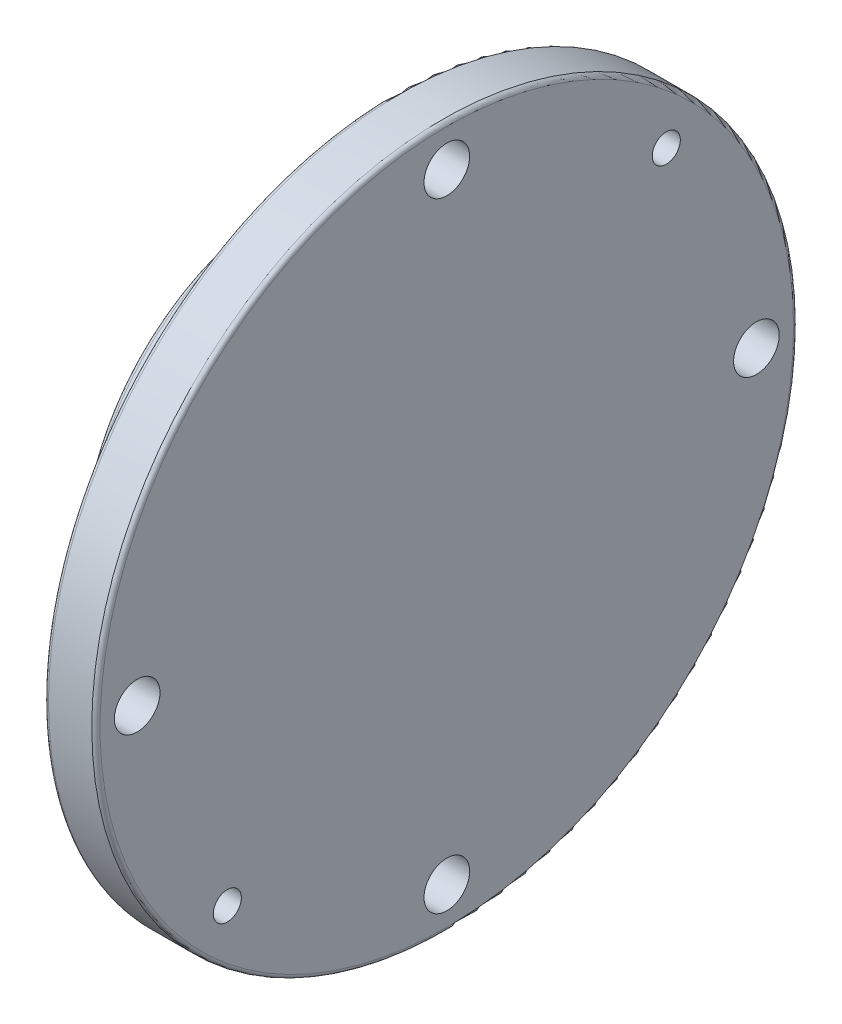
ISO-10303-21;
HEADER;
FILE_DESCRIPTION(('STEP AP214'),'2;1');
FILE_NAME('part.step','',(''),(''),'','','');
FILE_SCHEMA(('AUTOMOTIVE_DESIGN { 1 0 10303 214 1 1 1 1 }'));
ENDSEC;
DATA;
#1=APPLICATION_CONTEXT('core data for automotive mechanical design processes');
#2=APPLICATION_PROTOCOL_DEFINITION('international standard','automotive_design',2000,#1);
#3=PRODUCT_CONTEXT('',#1,'mechanical');
#4=PRODUCT('Part','Part','',(#3));
#5=PRODUCT_RELATED_PRODUCT_CATEGORY('part','',(#4));
#6=PRODUCT_DEFINITION_FORMATION('','',#4);
#7=PRODUCT_DEFINITION_CONTEXT('part definition',#1,'design');
#8=PRODUCT_DEFINITION('design','',#6,#7);
#9=PRODUCT_DEFINITION_SHAPE('','',#8);
#10=(LENGTH_UNIT() NAMED_UNIT(*) SI_UNIT(.MILLI.,.METRE.));
#11=(NAMED_UNIT(*) PLANE_ANGLE_UNIT() SI_UNIT($,.RADIAN.));
#12=(NAMED_UNIT(*) SI_UNIT($,.STERADIAN.) SOLID_ANGLE_UNIT());
#13=UNCERTAINTY_MEASURE_WITH_UNIT(LENGTH_MEASURE(1.E-05),#10,'distance_accuracy_value','');
#14=(GEOMETRIC_REPRESENTATION_CONTEXT(3) GLOBAL_UNCERTAINTY_ASSIGNED_CONTEXT((#13)) GLOBAL_UNIT_ASSIGNED_CONTEXT((#10,
#11,#12)) REPRESENTATION_CONTEXT('',''));
#15=CARTESIAN_POINT('',(0.,0.,0.));
#16=DIRECTION('',(0.,0.,1.));
#17=DIRECTION('',(1.,0.,0.));
#18=AXIS2_PLACEMENT_3D('',#15,#16,#17);
#19=CARTESIAN_POINT('',(0.,0.,0.));
#20=DIRECTION('',(1.,0.,0.));
#21=DIRECTION('',(0.,0.,-1.));
#22=AXIS2_PLACEMENT_3D('',#19,#20,#21);
#23=PLANE('',#22);
#24=CARTESIAN_POINT('',(0.,-26.8726771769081,27.0086878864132));
#25=DIRECTION('',(1.,0.,0.));
#26=DIRECTION('',(0.,0.,-1.));
#27=AXIS2_PLACEMENT_3D('',#24,#25,#26);
#28=CIRCLE('',#27,1.72719999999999);
#29=CARTESIAN_POINT('',(0.,-26.8726771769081,25.2814878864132));
#30=VERTEX_POINT('',#29);
#31=EDGE_CURVE('E422',#30,#30,#28,.T.);
#32=ORIENTED_EDGE('',*,*,#31,.F.);
#33=EDGE_LOOP('',(#32));
#34=FACE_BOUND('',#33,.T.);
#35=CARTESIAN_POINT('',(0.,26.8726771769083,-27.008687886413));
#36=DIRECTION('',(1.,0.,0.));
#37=DIRECTION('',(0.,0.,-1.));
#38=AXIS2_PLACEMENT_3D('',#35,#36,#37);
#39=CIRCLE('',#38,1.72719999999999);
#40=CARTESIAN_POINT('',(0.,26.8726771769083,-28.735887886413));
#41=VERTEX_POINT('',#40);
#42=EDGE_CURVE('E412',#41,#41,#39,.T.);
#43=ORIENTED_EDGE('',*,*,#42,.F.);
#44=EDGE_LOOP('',(#43));
#45=FACE_BOUND('',#44,.T.);
#46=CARTESIAN_POINT('',(0.,0.,38.1));
#47=DIRECTION('',(1.,0.,0.));
#48=DIRECTION('',(0.,0.,-1.));
#49=AXIS2_PLACEMENT_3D('',#46,#47,#48);
#50=CIRCLE('',#49,2.8067);
#51=CARTESIAN_POINT('',(0.,0.,35.2933));
#52=VERTEX_POINT('',#51);
#53=EDGE_CURVE('E409',#52,#52,#50,.T.);
#54=ORIENTED_EDGE('',*,*,#53,.F.);
#55=EDGE_LOOP('',(#54));
#56=FACE_BOUND('',#55,.T.);
#57=CARTESIAN_POINT('',(0.,-38.1,0.));
#58=DIRECTION('',(1.,0.,0.));
#59=DIRECTION('',(0.,0.,-1.));
#60=AXIS2_PLACEMENT_3D('',#57,#58,#59);
#61=CIRCLE('',#60,2.80670000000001);
#62=CARTESIAN_POINT('',(0.,-38.1,-2.80670000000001));
#63=VERTEX_POINT('',#62);
#64=EDGE_CURVE('E406',#63,#63,#61,.T.);
#65=ORIENTED_EDGE('',*,*,#64,.F.);
#66=EDGE_LOOP('',(#65));
#67=FACE_BOUND('',#66,.T.);
#68=CARTESIAN_POINT('',(0.,0.,-38.1));
#69=DIRECTION('',(1.,0.,0.));
#70=DIRECTION('',(0.,0.,-1.));
#71=AXIS2_PLACEMENT_3D('',#68,#69,#70);
#72=CIRCLE('',#71,2.8067);
#73=CARTESIAN_POINT('',(0.,0.,-40.9067));
#74=VERTEX_POINT('',#73);
#75=EDGE_CURVE('E402',#74,#74,#72,.T.);
#76=ORIENTED_EDGE('',*,*,#75,.F.);
#77=EDGE_LOOP('',(#76));
#78=FACE_BOUND('',#77,.T.);
#79=CARTESIAN_POINT('',(0.,38.1,0.));
#80=DIRECTION('',(1.,0.,0.));
#81=DIRECTION('',(0.,0.,-1.));
#82=AXIS2_PLACEMENT_3D('',#79,#80,#81);
#83=CIRCLE('',#82,2.8067);
#84=CARTESIAN_POINT('',(0.,38.1,-2.8067));
#85=VERTEX_POINT('',#84);
#86=EDGE_CURVE('E398',#85,#85,#83,.T.);
#87=ORIENTED_EDGE('',*,*,#86,.F.);
#88=EDGE_LOOP('',(#87));
#89=FACE_BOUND('',#88,.T.);
#90=CARTESIAN_POINT('',(0.,0.,0.));
#91=DIRECTION('',(1.,0.,0.));
#92=DIRECTION('',(0.,0.,-1.));
#93=AXIS2_PLACEMENT_3D('',#90,#91,#92);
#94=CIRCLE('',#93,42.672);
#95=CARTESIAN_POINT('',(0.,0.,-42.672));
#96=VERTEX_POINT('',#95);
#97=EDGE_CURVE('E10',#96,#96,#94,.T.);
#98=ORIENTED_EDGE('',*,*,#97,.T.);
#99=EDGE_LOOP('',(#98));
#100=FACE_BOUND('',#99,.T.);
#101=ADVANCED_FACE('F378',(#34,#45,#56,#67,#78,#89,#100),#23,.T.);
#102=CARTESIAN_POINT('',(-0.508000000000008,0.,0.));
#103=DIRECTION('',(1.,0.,0.));
#104=DIRECTION('',(0.,0.,-1.));
#105=AXIS2_PLACEMENT_3D('',#102,#103,#104);
#106=TOROIDAL_SURFACE('',#105,42.672,0.508000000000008);
#107=CARTESIAN_POINT('',(-0.508000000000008,0.,0.));
#108=DIRECTION('',(1.,0.,0.));
#109=DIRECTION('',(0.,0.,-1.));
#110=AXIS2_PLACEMENT_3D('',#107,#108,#109);
#111=CIRCLE('',#110,43.18);
#112=CARTESIAN_POINT('',(-0.508000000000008,0.,-43.18));
#113=VERTEX_POINT('',#112);
#114=EDGE_CURVE('E385',#113,#113,#111,.T.);
#115=ORIENTED_EDGE('',*,*,#114,.T.);
#116=EDGE_LOOP('',(#115));
#117=FACE_BOUND('',#116,.T.);
#118=ORIENTED_EDGE('',*,*,#97,.F.);
#119=EDGE_LOOP('',(#118));
#120=FACE_BOUND('',#119,.T.);
#121=ADVANCED_FACE('F511',(#117,#120),#106,.T.);
#122=CARTESIAN_POINT('',(0.,0.,0.));
#123=DIRECTION('',(1.,0.,0.));
#124=DIRECTION('',(0.,0.,-1.));
#125=AXIS2_PLACEMENT_3D('',#122,#123,#124);
#126=CYLINDRICAL_SURFACE('',#125,43.18);
#127=CARTESIAN_POINT('',(-5.84199999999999,0.,0.));
#128=DIRECTION('',(1.,0.,0.));
#129=DIRECTION('',(0.,0.,-1.));
#130=AXIS2_PLACEMENT_3D('',#127,#128,#129);
#131=CIRCLE('',#130,43.18);
#132=CARTESIAN_POINT('',(-5.84199999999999,0.,-43.18));
#133=VERTEX_POINT('',#132);
#134=EDGE_CURVE('E390',#133,#133,#131,.T.);
#135=ORIENTED_EDGE('',*,*,#134,.T.);
#136=EDGE_LOOP('',(#135));
#137=FACE_BOUND('',#136,.T.);
#138=ORIENTED_EDGE('',*,*,#114,.F.);
#139=EDGE_LOOP('',(#138));
#140=FACE_BOUND('',#139,.T.);
#141=ADVANCED_FACE('F495',(#137,#140),#126,.T.);
#142=CARTESIAN_POINT('',(-5.84199999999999,0.,0.));
#143=DIRECTION('',(1.,0.,0.));
#144=DIRECTION('',(0.,0.,-1.));
#145=AXIS2_PLACEMENT_3D('',#142,#143,#144);
#146=TOROIDAL_SURFACE('',#145,42.672,0.507999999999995);
#147=CARTESIAN_POINT('',(-6.34999999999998,0.,0.));
#148=DIRECTION('',(1.,0.,0.));
#149=DIRECTION('',(0.,0.,-1.));
#150=AXIS2_PLACEMENT_3D('',#147,#148,#149);
#151=CIRCLE('',#150,42.672);
#152=CARTESIAN_POINT('',(-6.34999999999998,0.,-42.672));
#153=VERTEX_POINT('',#152);
#154=EDGE_CURVE('E490',#153,#153,#151,.T.);
#155=ORIENTED_EDGE('',*,*,#154,.T.);
#156=EDGE_LOOP('',(#155));
#157=FACE_BOUND('',#156,.T.);
#158=ORIENTED_EDGE('',*,*,#134,.F.);
#159=EDGE_LOOP('',(#158));
#160=FACE_BOUND('',#159,.T.);
#161=ADVANCED_FACE('F498',(#157,#160),#146,.T.);
#162=CARTESIAN_POINT('',(-6.35,33.2486,0.));
#163=DIRECTION('',(-1.,0.,0.));
#164=DIRECTION('',(0.,0.,1.));
#165=AXIS2_PLACEMENT_3D('',#162,#163,#164);
#166=PLANE('',#165);
#167=CARTESIAN_POINT('',(-6.35,-26.8726771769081,27.0086878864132));
#168=DIRECTION('',(-1.,0.,0.));
#169=DIRECTION('',(0.,0.,1.));
#170=AXIS2_PLACEMENT_3D('',#167,#168,#169);
#171=CIRCLE('',#170,1.72719999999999);
#172=CARTESIAN_POINT('',(-6.35,-26.8726771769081,28.7358878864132));
#173=VERTEX_POINT('',#172);
#174=EDGE_CURVE('E381',#173,#173,#171,.T.);
#175=ORIENTED_EDGE('',*,*,#174,.F.);
#176=EDGE_LOOP('',(#175));
#177=FACE_BOUND('',#176,.T.);
#178=CARTESIAN_POINT('',(-6.35,26.8726771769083,-27.008687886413));
#179=DIRECTION('',(-1.,0.,0.));
#180=DIRECTION('',(0.,0.,1.));
#181=AXIS2_PLACEMENT_3D('',#178,#179,#180);
#182=CIRCLE('',#181,1.72719999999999);
#183=CARTESIAN_POINT('',(-6.35,26.8726771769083,-25.281487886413));
#184=VERTEX_POINT('',#183);
#185=EDGE_CURVE('E410',#184,#184,#182,.T.);
#186=ORIENTED_EDGE('',*,*,#185,.F.);
#187=EDGE_LOOP('',(#186));
#188=FACE_BOUND('',#187,.T.);
#189=CARTESIAN_POINT('',(-6.35,0.,38.1));
#190=DIRECTION('',(-1.,0.,0.));
#191=DIRECTION('',(0.,0.,1.));
#192=AXIS2_PLACEMENT_3D('',#189,#190,#191);
#193=CIRCLE('',#192,2.8067);
#194=CARTESIAN_POINT('',(-6.35,0.,40.9067));
#195=VERTEX_POINT('',#194);
#196=EDGE_CURVE('E407',#195,#195,#193,.T.);
#197=ORIENTED_EDGE('',*,*,#196,.F.);
#198=EDGE_LOOP('',(#197));
#199=FACE_BOUND('',#198,.T.);
#200=CARTESIAN_POINT('',(-6.35,-38.1,0.));
#201=DIRECTION('',(-1.,0.,0.));
#202=DIRECTION('',(0.,0.,1.));
#203=AXIS2_PLACEMENT_3D('',#200,#201,#202);
#204=CIRCLE('',#203,2.80670000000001);
#205=CARTESIAN_POINT('',(-6.35,-38.1,2.80670000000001));
#206=VERTEX_POINT('',#205);
#207=EDGE_CURVE('E403',#206,#206,#204,.T.);
#208=ORIENTED_EDGE('',*,*,#207,.F.);
#209=EDGE_LOOP('',(#208));
#210=FACE_BOUND('',#209,.T.);
#211=CARTESIAN_POINT('',(-6.35,0.,-38.1));
#212=DIRECTION('',(-1.,0.,0.));
#213=DIRECTION('',(0.,0.,1.));
#214=AXIS2_PLACEMENT_3D('',#211,#212,#213);
#215=CIRCLE('',#214,2.8067);
#216=CARTESIAN_POINT('',(-6.35,0.,-35.2933));
#217=VERTEX_POINT('',#216);
#218=EDGE_CURVE('E399',#217,#217,#215,.T.);
#219=ORIENTED_EDGE('',*,*,#218,.F.);
#220=EDGE_LOOP('',(#219));
#221=FACE_BOUND('',#220,.T.);
#222=CARTESIAN_POINT('',(-6.35,38.1,0.));
#223=DIRECTION('',(-1.,0.,0.));
#224=DIRECTION('',(0.,0.,1.));
#225=AXIS2_PLACEMENT_3D('',#222,#223,#224);
#226=CIRCLE('',#225,2.8067);
#227=CARTESIAN_POINT('',(-6.35,38.1,2.8067));
#228=VERTEX_POINT('',#227);
#229=EDGE_CURVE('E394',#228,#228,#226,.T.);
#230=ORIENTED_EDGE('',*,*,#229,.F.);
#231=EDGE_LOOP('',(#230));
#232=FACE_BOUND('',#231,.T.);
#233=CARTESIAN_POINT('',(-6.35000000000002,0.,0.));
#234=DIRECTION('',(1.,0.,0.));
#235=DIRECTION('',(0.,0.,-1.));
#236=AXIS2_PLACEMENT_3D('',#233,#234,#235);
#237=CIRCLE('',#236,33.2486);
#238=CARTESIAN_POINT('',(-6.35000000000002,0.,-33.2486));
#239=VERTEX_POINT('',#238);
#240=EDGE_CURVE('E487',#239,#239,#237,.T.);
#241=ORIENTED_EDGE('',*,*,#240,.T.);
#242=EDGE_LOOP('',(#241));
#243=FACE_BOUND('',#242,.T.);
#244=ORIENTED_EDGE('',*,*,#154,.F.);
#245=EDGE_LOOP('',(#244));
#246=FACE_BOUND('',#245,.T.);
#247=ADVANCED_FACE('F500',(#177,#188,#199,#210,#221,#232,#243,#246),#166,.T.);
#248=CARTESIAN_POINT('',(-6.22300000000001,0.,0.));
#249=DIRECTION('',(1.,0.,0.));
#250=DIRECTION('',(0.,0.,-1.));
#251=AXIS2_PLACEMENT_3D('',#248,#249,#250);
#252=TOROIDAL_SURFACE('',#251,33.2486,0.127000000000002);
#253=CARTESIAN_POINT('',(-6.22300000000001,0.,0.));
#254=DIRECTION('',(1.,0.,0.));
#255=DIRECTION('',(0.,0.,-1.));
#256=AXIS2_PLACEMENT_3D('',#253,#254,#255);
#257=CIRCLE('',#256,33.1216);
#258=CARTESIAN_POINT('',(-6.22300000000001,0.,-33.1216));
#259=VERTEX_POINT('',#258);
#260=EDGE_CURVE('E484',#259,#259,#257,.T.);
#261=ORIENTED_EDGE('',*,*,#260,.T.);
#262=EDGE_LOOP('',(#261));
#263=FACE_BOUND('',#262,.T.);
#264=ORIENTED_EDGE('',*,*,#240,.F.);
#265=EDGE_LOOP('',(#264));
#266=FACE_BOUND('',#265,.T.);
#267=ADVANCED_FACE('F508',(#263,#266),#252,.T.);
#268=CARTESIAN_POINT('',(0.,0.,0.));
#269=DIRECTION('',(1.,0.,0.));
#270=DIRECTION('',(0.,0.,-1.));
#271=AXIS2_PLACEMENT_3D('',#268,#269,#270);
#272=CYLINDRICAL_SURFACE('',#271,33.1216);
#273=CARTESIAN_POINT('',(-4.14019999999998,0.,0.));
#274=DIRECTION('',(1.,0.,0.));
#275=DIRECTION('',(0.,0.,-1.));
#276=AXIS2_PLACEMENT_3D('',#273,#274,#275);
#277=CIRCLE('',#276,33.1216);
#278=CARTESIAN_POINT('',(-4.14019999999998,0.,-33.1216));
#279=VERTEX_POINT('',#278);
#280=EDGE_CURVE('E481',#279,#279,#277,.T.);
#281=ORIENTED_EDGE('',*,*,#280,.T.);
#282=EDGE_LOOP('',(#281));
#283=FACE_BOUND('',#282,.T.);
#284=ORIENTED_EDGE('',*,*,#260,.F.);
#285=EDGE_LOOP('',(#284));
#286=FACE_BOUND('',#285,.T.);
#287=ADVANCED_FACE('F616',(#283,#286),#272,.F.);
#288=CARTESIAN_POINT('',(-4.14019999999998,0.,0.));
#289=DIRECTION('',(1.,0.,0.));
#290=DIRECTION('',(0.,0.,-1.));
#291=AXIS2_PLACEMENT_3D('',#288,#289,#290);
#292=TOROIDAL_SURFACE('',#291,32.6136,0.508000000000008);
#293=CARTESIAN_POINT('',(-3.63219999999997,0.,0.));
#294=DIRECTION('',(1.,0.,0.));
#295=DIRECTION('',(0.,0.,-1.));
#296=AXIS2_PLACEMENT_3D('',#293,#294,#295);
#297=CIRCLE('',#296,32.6136);
#298=CARTESIAN_POINT('',(-3.63219999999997,0.,-32.6136));
#299=VERTEX_POINT('',#298);
#300=EDGE_CURVE('E478',#299,#299,#297,.T.);
#301=ORIENTED_EDGE('',*,*,#300,.T.);
#302=EDGE_LOOP('',(#301));
#303=FACE_BOUND('',#302,.T.);
#304=ORIENTED_EDGE('',*,*,#280,.F.);
#305=EDGE_LOOP('',(#304));
#306=FACE_BOUND('',#305,.T.);
#307=ADVANCED_FACE('F612',(#303,#306),#292,.F.);
#308=CARTESIAN_POINT('',(-3.63219999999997,28.8798,0.));
#309=DIRECTION('',(-1.,0.,0.));
#310=DIRECTION('',(0.,0.,1.));
#311=AXIS2_PLACEMENT_3D('',#308,#309,#310);
#312=PLANE('',#311);
#313=CARTESIAN_POINT('',(-3.63219999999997,0.,0.));
#314=DIRECTION('',(1.,0.,0.));
#315=DIRECTION('',(0.,0.,-1.));
#316=AXIS2_PLACEMENT_3D('',#313,#314,#315);
#317=CIRCLE('',#316,28.8798);
#318=CARTESIAN_POINT('',(-3.63219999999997,0.,-28.8798));
#319=VERTEX_POINT('',#318);
#320=EDGE_CURVE('E475',#319,#319,#317,.T.);
#321=ORIENTED_EDGE('',*,*,#320,.T.);
#322=EDGE_LOOP('',(#321));
#323=FACE_BOUND('',#322,.T.);
#324=ORIENTED_EDGE('',*,*,#300,.F.);
#325=EDGE_LOOP('',(#324));
#326=FACE_BOUND('',#325,.T.);
#327=ADVANCED_FACE('F608',(#323,#326),#312,.T.);
#328=CARTESIAN_POINT('',(-4.14019999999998,0.,0.));
#329=DIRECTION('',(1.,0.,0.));
#330=DIRECTION('',(0.,0.,-1.));
#331=AXIS2_PLACEMENT_3D('',#328,#329,#330);
#332=TOROIDAL_SURFACE('',#331,28.8798,0.508000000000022);
#333=CARTESIAN_POINT('',(-4.14019999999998,0.,0.));
#334=DIRECTION('',(1.,0.,0.));
#335=DIRECTION('',(0.,0.,-1.));
#336=AXIS2_PLACEMENT_3D('',#333,#334,#335);
#337=CIRCLE('',#336,28.3718);
#338=CARTESIAN_POINT('',(-4.14019999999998,0.,-28.3718));
#339=VERTEX_POINT('',#338);
#340=EDGE_CURVE('E472',#339,#339,#337,.T.);
#341=ORIENTED_EDGE('',*,*,#340,.T.);
#342=EDGE_LOOP('',(#341));
#343=FACE_BOUND('',#342,.T.);
#344=ORIENTED_EDGE('',*,*,#320,.F.);
#345=EDGE_LOOP('',(#344));
#346=FACE_BOUND('',#345,.T.);
#347=ADVANCED_FACE('F604',(#343,#346),#332,.F.);
#348=CARTESIAN_POINT('',(0.,0.,0.));
#349=DIRECTION('',(1.,0.,0.));
#350=DIRECTION('',(0.,0.,-1.));
#351=AXIS2_PLACEMENT_3D('',#348,#349,#350);
#352=CYLINDRICAL_SURFACE('',#351,28.3718);
#353=CARTESIAN_POINT('',(-6.22300000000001,0.,0.));
#354=DIRECTION('',(1.,0.,0.));
#355=DIRECTION('',(0.,0.,-1.));
#356=AXIS2_PLACEMENT_3D('',#353,#354,#355);
#357=CIRCLE('',#356,28.3718);
#358=CARTESIAN_POINT('',(-6.22300000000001,0.,-28.3718));
#359=VERTEX_POINT('',#358);
#360=EDGE_CURVE('E469',#359,#359,#357,.T.);
#361=ORIENTED_EDGE('',*,*,#360,.T.);
#362=EDGE_LOOP('',(#361));
#363=FACE_BOUND('',#362,.T.);
#364=ORIENTED_EDGE('',*,*,#340,.F.);
#365=EDGE_LOOP('',(#364));
#366=FACE_BOUND('',#365,.T.);
#367=ADVANCED_FACE('F600',(#363,#366),#352,.T.);
#368=CARTESIAN_POINT('',(-6.22300000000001,0.,0.));
#369=DIRECTION('',(1.,0.,0.));
#370=DIRECTION('',(0.,0.,-1.));
#371=AXIS2_PLACEMENT_3D('',#368,#369,#370);
#372=TOROIDAL_SURFACE('',#371,28.2448,0.12699999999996);
#373=CARTESIAN_POINT('',(-6.34999999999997,0.,0.));
#374=DIRECTION('',(1.,0.,0.));
#375=DIRECTION('',(0.,0.,-1.));
#376=AXIS2_PLACEMENT_3D('',#373,#374,#375);
#377=CIRCLE('',#376,28.2448);
#378=CARTESIAN_POINT('',(-6.34999999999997,0.,-28.2448));
#379=VERTEX_POINT('',#378);
#380=EDGE_CURVE('E466',#379,#379,#377,.T.);
#381=ORIENTED_EDGE('',*,*,#380,.T.);
#382=EDGE_LOOP('',(#381));
#383=FACE_BOUND('',#382,.T.);
#384=ORIENTED_EDGE('',*,*,#360,.F.);
#385=EDGE_LOOP('',(#384));
#386=FACE_BOUND('',#385,.T.);
#387=ADVANCED_FACE('F596',(#383,#386),#372,.T.);
#388=CARTESIAN_POINT('',(-6.34999999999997,26.1239,0.));
#389=DIRECTION('',(-1.,0.,0.));
#390=DIRECTION('',(0.,0.,1.));
#391=AXIS2_PLACEMENT_3D('',#388,#389,#390);
#392=PLANE('',#391);
#393=CARTESIAN_POINT('',(-6.34999999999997,0.,0.));
#394=DIRECTION('',(1.,0.,0.));
#395=DIRECTION('',(0.,0.,-1.));
#396=AXIS2_PLACEMENT_3D('',#393,#394,#395);
#397=CIRCLE('',#396,26.1239);
#398=CARTESIAN_POINT('',(-6.34999999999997,0.,-26.1239));
#399=VERTEX_POINT('',#398);
#400=EDGE_CURVE('E463',#399,#399,#397,.T.);
#401=ORIENTED_EDGE('',*,*,#400,.T.);
#402=EDGE_LOOP('',(#401));
#403=FACE_BOUND('',#402,.T.);
#404=ORIENTED_EDGE('',*,*,#380,.F.);
#405=EDGE_LOOP('',(#404));
#406=FACE_BOUND('',#405,.T.);
#407=ADVANCED_FACE('F592',(#403,#406),#392,.T.);
#408=CARTESIAN_POINT('',(-7.11200000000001,0.,0.));
#409=DIRECTION('',(1.,0.,0.));
#410=DIRECTION('',(0.,0.,-1.));
#411=AXIS2_PLACEMENT_3D('',#408,#409,#410);
#412=TOROIDAL_SURFACE('',#411,26.1239,0.762000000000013);
#413=CARTESIAN_POINT('',(-7.11200000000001,0.,0.));
#414=DIRECTION('',(1.,0.,0.));
#415=DIRECTION('',(0.,0.,-1.));
#416=AXIS2_PLACEMENT_3D('',#413,#414,#415);
#417=CIRCLE('',#416,25.3619);
#418=CARTESIAN_POINT('',(-7.11200000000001,0.,-25.3619));
#419=VERTEX_POINT('',#418);
#420=EDGE_CURVE('E460',#419,#419,#417,.T.);
#421=ORIENTED_EDGE('',*,*,#420,.T.);
#422=EDGE_LOOP('',(#421));
#423=FACE_BOUND('',#422,.T.);
#424=ORIENTED_EDGE('',*,*,#400,.F.);
#425=EDGE_LOOP('',(#424));
#426=FACE_BOUND('',#425,.T.);
#427=ADVANCED_FACE('F588',(#423,#426),#412,.F.);
#428=CARTESIAN_POINT('',(0.,0.,0.));
#429=DIRECTION('',(1.,0.,0.));
#430=DIRECTION('',(0.,0.,-1.));
#431=AXIS2_PLACEMENT_3D('',#428,#429,#430);
#432=CYLINDRICAL_SURFACE('',#431,25.3619);
#433=CARTESIAN_POINT('',(-10.795,0.,0.));
#434=DIRECTION('',(1.,0.,0.));
#435=DIRECTION('',(0.,0.,-1.));
#436=AXIS2_PLACEMENT_3D('',#433,#434,#435);
#437=CIRCLE('',#436,25.3619);
#438=CARTESIAN_POINT('',(-10.795,0.,-25.3619));
#439=VERTEX_POINT('',#438);
#440=EDGE_CURVE('E457',#439,#439,#437,.T.);
#441=ORIENTED_EDGE('',*,*,#440,.T.);
#442=EDGE_LOOP('',(#441));
#443=FACE_BOUND('',#442,.T.);
#444=ORIENTED_EDGE('',*,*,#420,.F.);
#445=EDGE_LOOP('',(#444));
#446=FACE_BOUND('',#445,.T.);
#447=ADVANCED_FACE('F584',(#443,#446),#432,.T.);
#448=CARTESIAN_POINT('',(-10.795,0.,0.));
#449=DIRECTION('',(1.,0.,0.));
#450=DIRECTION('',(0.,0.,-1.));
#451=AXIS2_PLACEMENT_3D('',#448,#449,#450);
#452=TOROIDAL_SURFACE('',#451,25.2349,0.126999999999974);
#453=CARTESIAN_POINT('',(-10.922,0.,0.));
#454=DIRECTION('',(1.,0.,0.));
#455=DIRECTION('',(0.,0.,-1.));
#456=AXIS2_PLACEMENT_3D('',#453,#454,#455);
#457=CIRCLE('',#456,25.2349);
#458=CARTESIAN_POINT('',(-10.922,0.,-25.2349));
#459=VERTEX_POINT('',#458);
#460=EDGE_CURVE('E454',#459,#459,#457,.T.);
#461=ORIENTED_EDGE('',*,*,#460,.T.);
#462=EDGE_LOOP('',(#461));
#463=FACE_BOUND('',#462,.T.);
#464=ORIENTED_EDGE('',*,*,#440,.F.);
#465=EDGE_LOOP('',(#464));
#466=FACE_BOUND('',#465,.T.);
#467=ADVANCED_FACE('F580',(#463,#466),#452,.T.);
#468=CARTESIAN_POINT('',(-10.922,23.0886,0.));
#469=DIRECTION('',(-1.,0.,0.));
#470=DIRECTION('',(0.,0.,1.));
#471=AXIS2_PLACEMENT_3D('',#468,#469,#470);
#472=PLANE('',#471);
#473=CARTESIAN_POINT('',(-10.922,0.,0.));
#474=DIRECTION('',(1.,0.,0.));
#475=DIRECTION('',(0.,0.,-1.));
#476=AXIS2_PLACEMENT_3D('',#473,#474,#475);
#477=CIRCLE('',#476,23.0886);
#478=CARTESIAN_POINT('',(-10.922,0.,-23.0886));
#479=VERTEX_POINT('',#478);
#480=EDGE_CURVE('E451',#479,#479,#477,.T.);
#481=ORIENTED_EDGE('',*,*,#480,.T.);
#482=EDGE_LOOP('',(#481));
#483=FACE_BOUND('',#482,.T.);
#484=ORIENTED_EDGE('',*,*,#460,.F.);
#485=EDGE_LOOP('',(#484));
#486=FACE_BOUND('',#485,.T.);
#487=ADVANCED_FACE('F576',(#483,#486),#472,.T.);
#488=CARTESIAN_POINT('',(-11.43,0.,0.));
#489=DIRECTION('',(1.,0.,0.));
#490=DIRECTION('',(0.,0.,-1.));
#491=AXIS2_PLACEMENT_3D('',#488,#489,#490);
#492=TOROIDAL_SURFACE('',#491,23.0886,0.508000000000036);
#493=CARTESIAN_POINT('',(-11.43,0.,0.));
#494=DIRECTION('',(1.,0.,0.));
#495=DIRECTION('',(0.,0.,-1.));
#496=AXIS2_PLACEMENT_3D('',#493,#494,#495);
#497=CIRCLE('',#496,22.5806);
#498=CARTESIAN_POINT('',(-11.43,0.,-22.5806));
#499=VERTEX_POINT('',#498);
#500=EDGE_CURVE('E448',#499,#499,#497,.T.);
#501=ORIENTED_EDGE('',*,*,#500,.T.);
#502=EDGE_LOOP('',(#501));
#503=FACE_BOUND('',#502,.T.);
#504=ORIENTED_EDGE('',*,*,#480,.F.);
#505=EDGE_LOOP('',(#504));
#506=FACE_BOUND('',#505,.T.);
#507=ADVANCED_FACE('F572',(#503,#506),#492,.F.);
#508=CARTESIAN_POINT('',(0.,0.,0.));
#509=DIRECTION('',(1.,0.,0.));
#510=DIRECTION('',(0.,0.,-1.));
#511=AXIS2_PLACEMENT_3D('',#508,#509,#510);
#512=CYLINDRICAL_SURFACE('',#511,22.5806);
#513=CARTESIAN_POINT('',(-15.2908,0.,0.));
#514=DIRECTION('',(1.,0.,0.));
#515=DIRECTION('',(0.,0.,-1.));
#516=AXIS2_PLACEMENT_3D('',#513,#514,#515);
#517=CIRCLE('',#516,22.5806);
#518=CARTESIAN_POINT('',(-15.2908,0.,-22.5806));
#519=VERTEX_POINT('',#518);
#520=EDGE_CURVE('E445',#519,#519,#517,.T.);
#521=ORIENTED_EDGE('',*,*,#520,.T.);
#522=EDGE_LOOP('',(#521));
#523=FACE_BOUND('',#522,.T.);
#524=ORIENTED_EDGE('',*,*,#500,.F.);
#525=EDGE_LOOP('',(#524));
#526=FACE_BOUND('',#525,.T.);
#527=ADVANCED_FACE('F568',(#523,#526),#512,.T.);
#528=CARTESIAN_POINT('',(-15.2908,0.,0.));
#529=DIRECTION('',(1.,0.,0.));
#530=DIRECTION('',(0.,0.,-1.));
#531=AXIS2_PLACEMENT_3D('',#528,#529,#530);
#532=TOROIDAL_SURFACE('',#531,23.0886,0.508000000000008);
#533=CARTESIAN_POINT('',(-15.7988,0.,0.));
#534=DIRECTION('',(1.,0.,0.));
#535=DIRECTION('',(0.,0.,-1.));
#536=AXIS2_PLACEMENT_3D('',#533,#534,#535);
#537=CIRCLE('',#536,23.0886);
#538=CARTESIAN_POINT('',(-15.7988,0.,-23.0886));
#539=VERTEX_POINT('',#538);
#540=EDGE_CURVE('E442',#539,#539,#537,.T.);
#541=ORIENTED_EDGE('',*,*,#540,.T.);
#542=EDGE_LOOP('',(#541));
#543=FACE_BOUND('',#542,.T.);
#544=ORIENTED_EDGE('',*,*,#520,.F.);
#545=EDGE_LOOP('',(#544));
#546=FACE_BOUND('',#545,.T.);
#547=ADVANCED_FACE('F564',(#543,#546),#532,.F.);
#548=CARTESIAN_POINT('',(-15.7988,23.0886,0.));
#549=DIRECTION('',(1.,0.,0.));
#550=DIRECTION('',(0.,0.,-1.));
#551=AXIS2_PLACEMENT_3D('',#548,#549,#550);
#552=PLANE('',#551);
#553=CARTESIAN_POINT('',(-15.7988,0.,0.));
#554=DIRECTION('',(1.,0.,0.));
#555=DIRECTION('',(0.,0.,-1.));
#556=AXIS2_PLACEMENT_3D('',#553,#554,#555);
#557=CIRCLE('',#556,25.2349);
#558=CARTESIAN_POINT('',(-15.7988,0.,-25.2349));
#559=VERTEX_POINT('',#558);
#560=EDGE_CURVE('E439',#559,#559,#557,.T.);
#561=ORIENTED_EDGE('',*,*,#560,.T.);
#562=EDGE_LOOP('',(#561));
#563=FACE_BOUND('',#562,.T.);
#564=ORIENTED_EDGE('',*,*,#540,.F.);
#565=EDGE_LOOP('',(#564));
#566=FACE_BOUND('',#565,.T.);
#567=ADVANCED_FACE('F560',(#563,#566),#552,.T.);
#568=CARTESIAN_POINT('',(-15.9258,0.,0.));
#569=DIRECTION('',(1.,0.,0.));
#570=DIRECTION('',(0.,0.,-1.));
#571=AXIS2_PLACEMENT_3D('',#568,#569,#570);
#572=TOROIDAL_SURFACE('',#571,25.2349,0.127000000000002);
#573=CARTESIAN_POINT('',(-15.9258,0.,0.));
#574=DIRECTION('',(1.,0.,0.));
#575=DIRECTION('',(0.,0.,-1.));
#576=AXIS2_PLACEMENT_3D('',#573,#574,#575);
#577=CIRCLE('',#576,25.3619);
#578=CARTESIAN_POINT('',(-15.9258,0.,-25.3619));
#579=VERTEX_POINT('',#578);
#580=EDGE_CURVE('E436',#579,#579,#577,.T.);
#581=ORIENTED_EDGE('',*,*,#580,.T.);
#582=EDGE_LOOP('',(#581));
#583=FACE_BOUND('',#582,.T.);
#584=ORIENTED_EDGE('',*,*,#560,.F.);
#585=EDGE_LOOP('',(#584));
#586=FACE_BOUND('',#585,.T.);
#587=ADVANCED_FACE('F556',(#583,#586),#572,.T.);
#588=CARTESIAN_POINT('',(0.,0.,0.));
#589=DIRECTION('',(1.,0.,0.));
#590=DIRECTION('',(0.,0.,-1.));
#591=AXIS2_PLACEMENT_3D('',#588,#589,#590);
#592=CYLINDRICAL_SURFACE('',#591,25.3619);
#593=CARTESIAN_POINT('',(-19.12234886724,0.,0.));
#594=DIRECTION('',(1.,0.,0.));
#595=DIRECTION('',(0.,0.,-1.));
#596=AXIS2_PLACEMENT_3D('',#593,#594,#595);
#597=CIRCLE('',#596,25.3619);
#598=CARTESIAN_POINT('',(-19.12234886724,0.,-25.3619));
#599=VERTEX_POINT('',#598);
#600=EDGE_CURVE('E433',#599,#599,#597,.T.);
#601=ORIENTED_EDGE('',*,*,#600,.T.);
#602=EDGE_LOOP('',(#601));
#603=FACE_BOUND('',#602,.T.);
#604=ORIENTED_EDGE('',*,*,#580,.F.);
#605=EDGE_LOOP('',(#604));
#606=FACE_BOUND('',#605,.T.);
#607=ADVANCED_FACE('F552',(#603,#606),#592,.T.);
#608=CARTESIAN_POINT('',(-19.12234886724,0.,0.));
#609=DIRECTION('',(1.,0.,0.));
#610=DIRECTION('',(0.,0.,-1.));
#611=AXIS2_PLACEMENT_3D('',#608,#609,#610);
#612=TOROIDAL_SURFACE('',#611,24.8539,0.508000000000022);
#613=CARTESIAN_POINT('',(-19.63034886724,0.,0.));
#614=DIRECTION('',(1.,0.,0.));
#615=DIRECTION('',(0.,0.,-1.));
#616=AXIS2_PLACEMENT_3D('',#613,#614,#615);
#617=CIRCLE('',#616,24.8539);
#618=CARTESIAN_POINT('',(-19.63034886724,0.,-24.8539));
#619=VERTEX_POINT('',#618);
#620=EDGE_CURVE('E397',#619,#619,#617,.T.);
#621=ORIENTED_EDGE('',*,*,#620,.T.);
#622=EDGE_LOOP('',(#621));
#623=FACE_BOUND('',#622,.T.);
#624=ORIENTED_EDGE('',*,*,#600,.F.);
#625=EDGE_LOOP('',(#624));
#626=FACE_BOUND('',#625,.T.);
#627=ADVANCED_FACE('F545',(#623,#626),#612,.T.);
#628=CARTESIAN_POINT('',(-19.63034886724,0.,0.));
#629=DIRECTION('',(-1.,0.,0.));
#630=DIRECTION('',(0.,0.,1.));
#631=AXIS2_PLACEMENT_3D('',#628,#629,#630);
#632=PLANE('',#631);
#633=ORIENTED_EDGE('',*,*,#620,.F.);
#634=EDGE_LOOP('',(#633));
#635=FACE_BOUND('',#634,.T.);
#636=ADVANCED_FACE('F535',(#635),#632,.T.);
#637=CARTESIAN_POINT('',(-19.63034886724,38.1,0.));
#638=DIRECTION('',(1.,0.,0.));
#639=DIRECTION('',(0.,0.,-1.));
#640=AXIS2_PLACEMENT_3D('',#637,#638,#639);
#641=CYLINDRICAL_SURFACE('',#640,2.8067);
#642=ORIENTED_EDGE('',*,*,#229,.T.);
#643=EDGE_LOOP('',(#642));
#644=FACE_BOUND('',#643,.T.);
#645=ORIENTED_EDGE('',*,*,#86,.T.);
#646=EDGE_LOOP('',(#645));
#647=FACE_BOUND('',#646,.T.);
#648=ADVANCED_FACE('F532',(#644,#647),#641,.F.);
#649=CARTESIAN_POINT('',(-19.63034886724,0.,-38.1));
#650=DIRECTION('',(1.,0.,0.));
#651=DIRECTION('',(0.,0.,-1.));
#652=AXIS2_PLACEMENT_3D('',#649,#650,#651);
#653=CYLINDRICAL_SURFACE('',#652,2.8067);
#654=ORIENTED_EDGE('',*,*,#218,.T.);
#655=EDGE_LOOP('',(#654));
#656=FACE_BOUND('',#655,.T.);
#657=ORIENTED_EDGE('',*,*,#75,.T.);
#658=EDGE_LOOP('',(#657));
#659=FACE_BOUND('',#658,.T.);
#660=ADVANCED_FACE('F534',(#656,#659),#653,.F.);
#661=CARTESIAN_POINT('',(-19.63034886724,-38.1,0.));
#662=DIRECTION('',(1.,0.,0.));
#663=DIRECTION('',(0.,0.,-1.));
#664=AXIS2_PLACEMENT_3D('',#661,#662,#663);
#665=CYLINDRICAL_SURFACE('',#664,2.80670000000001);
#666=ORIENTED_EDGE('',*,*,#207,.T.);
#667=EDGE_LOOP('',(#666));
#668=FACE_BOUND('',#667,.T.);
#669=ORIENTED_EDGE('',*,*,#64,.T.);
#670=EDGE_LOOP('',(#669));
#671=FACE_BOUND('',#670,.T.);
#672=ADVANCED_FACE('F542',(#668,#671),#665,.F.);
#673=CARTESIAN_POINT('',(-19.63034886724,0.,38.1));
#674=DIRECTION('',(1.,0.,0.));
#675=DIRECTION('',(0.,0.,-1.));
#676=AXIS2_PLACEMENT_3D('',#673,#674,#675);
#677=CYLINDRICAL_SURFACE('',#676,2.8067);
#678=ORIENTED_EDGE('',*,*,#196,.T.);
#679=EDGE_LOOP('',(#678));
#680=FACE_BOUND('',#679,.T.);
#681=ORIENTED_EDGE('',*,*,#53,.T.);
#682=EDGE_LOOP('',(#681));
#683=FACE_BOUND('',#682,.T.);
#684=ADVANCED_FACE('F721',(#680,#683),#677,.F.);
#685=CARTESIAN_POINT('',(0.,26.8726771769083,-27.008687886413));
#686=DIRECTION('',(1.,0.,0.));
#687=DIRECTION('',(0.,0.,-1.));
#688=AXIS2_PLACEMENT_3D('',#685,#686,#687);
#689=CYLINDRICAL_SURFACE('',#688,1.72719999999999);
#690=ORIENTED_EDGE('',*,*,#185,.T.);
#691=EDGE_LOOP('',(#690));
#692=FACE_BOUND('',#691,.T.);
#693=ORIENTED_EDGE('',*,*,#42,.T.);
#694=EDGE_LOOP('',(#693));
#695=FACE_BOUND('',#694,.T.);
#696=ADVANCED_FACE('F728',(#692,#695),#689,.F.);
#697=CARTESIAN_POINT('',(0.,-26.8726771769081,27.0086878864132));
#698=DIRECTION('',(1.,0.,0.));
#699=DIRECTION('',(0.,0.,-1.));
#700=AXIS2_PLACEMENT_3D('',#697,#698,#699);
#701=CYLINDRICAL_SURFACE('',#700,1.72719999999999);
#702=ORIENTED_EDGE('',*,*,#174,.T.);
#703=EDGE_LOOP('',(#702));
#704=FACE_BOUND('',#703,.T.);
#705=ORIENTED_EDGE('',*,*,#31,.T.);
#706=EDGE_LOOP('',(#705));
#707=FACE_BOUND('',#706,.T.);
#708=ADVANCED_FACE('F735',(#704,#707),#701,.F.);
#709=CLOSED_SHELL('',(#101,#121,#141,#161,#247,#267,#287,#307,#327,#347,#367,#387,#407,#427,
#447,#467,#487,#507,#527,#547,#567,#587,#607,#627,#636,#648,#660,#672,#684,#696,#708));
#710=MANIFOLD_SOLID_BREP('B2',#709);
#711=ADVANCED_BREP_SHAPE_REPRESENTATION('',(#18,#710),#14);
#712=SHAPE_DEFINITION_REPRESENTATION(#9,#711);
ENDSEC;
END-ISO-10303-21;
